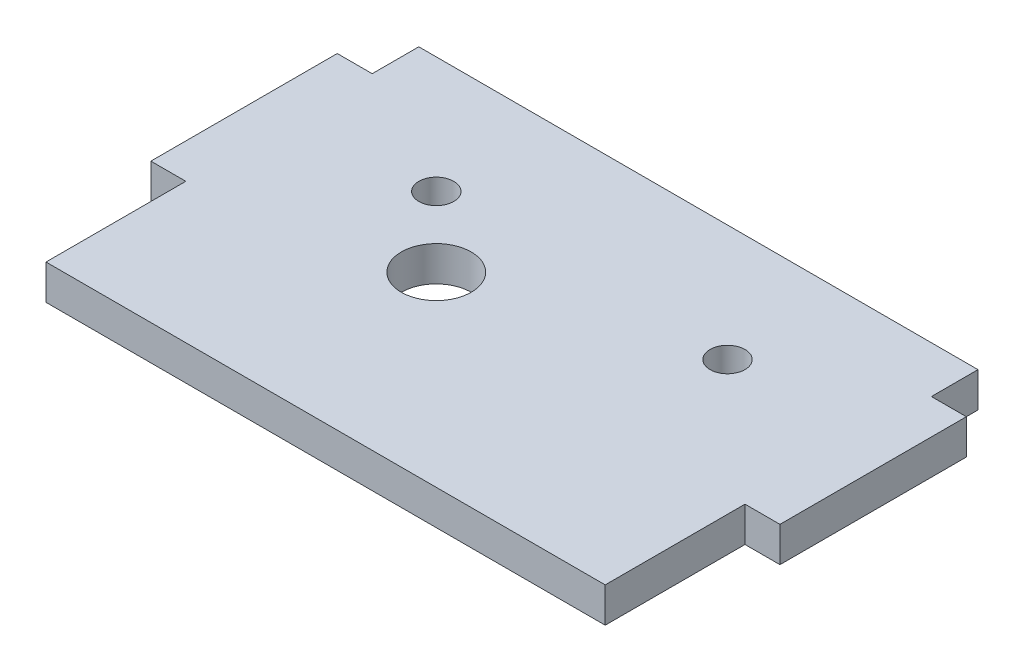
ISO-10303-21;
HEADER;
FILE_DESCRIPTION(('STEP AP214'),'2;1');
FILE_NAME('part.step','',(''),(''),'','','');
FILE_SCHEMA(('AUTOMOTIVE_DESIGN { 1 0 10303 214 1 1 1 1 }'));
ENDSEC;
DATA;
#1=APPLICATION_CONTEXT('core data for automotive mechanical design processes');
#2=APPLICATION_PROTOCOL_DEFINITION('international standard','automotive_design',2000,#1);
#3=PRODUCT_CONTEXT('',#1,'mechanical');
#4=PRODUCT('Part','Part','',(#3));
#5=PRODUCT_RELATED_PRODUCT_CATEGORY('part','',(#4));
#6=PRODUCT_DEFINITION_FORMATION('','',#4);
#7=PRODUCT_DEFINITION_CONTEXT('part definition',#1,'design');
#8=PRODUCT_DEFINITION('design','',#6,#7);
#9=PRODUCT_DEFINITION_SHAPE('','',#8);
#10=(LENGTH_UNIT() NAMED_UNIT(*) SI_UNIT(.MILLI.,.METRE.));
#11=(NAMED_UNIT(*) PLANE_ANGLE_UNIT() SI_UNIT($,.RADIAN.));
#12=(NAMED_UNIT(*) SI_UNIT($,.STERADIAN.) SOLID_ANGLE_UNIT());
#13=UNCERTAINTY_MEASURE_WITH_UNIT(LENGTH_MEASURE(1.E-05),#10,'distance_accuracy_value','');
#14=(GEOMETRIC_REPRESENTATION_CONTEXT(3) GLOBAL_UNCERTAINTY_ASSIGNED_CONTEXT((#13)) GLOBAL_UNIT_ASSIGNED_CONTEXT((#10,
#11,#12)) REPRESENTATION_CONTEXT('',''));
#15=CARTESIAN_POINT('',(0.,0.,0.));
#16=DIRECTION('',(0.,0.,1.));
#17=DIRECTION('',(1.,0.,0.));
#18=AXIS2_PLACEMENT_3D('',#15,#16,#17);
#19=CARTESIAN_POINT('',(24.,3.,-10.));
#20=DIRECTION('',(-1.,0.,0.));
#21=DIRECTION('',(0.,0.,1.));
#22=AXIS2_PLACEMENT_3D('',#19,#20,#21);
#23=PLANE('',#22);
#24=DIRECTION('',(0.,-1.,0.));
#25=VECTOR('',#24,1.);
#26=CARTESIAN_POINT('',(24.,3.,10.));
#27=LINE('',#26,#25);
#28=CARTESIAN_POINT('',(24.,3.,10.));
#29=VERTEX_POINT('',#28);
#30=CARTESIAN_POINT('',(24.,0.,10.));
#31=VERTEX_POINT('',#30);
#32=EDGE_CURVE('E55',#29,#31,#27,.T.);
#33=ORIENTED_EDGE('',*,*,#32,.F.);
#34=DIRECTION('',(0.,0.,-1.));
#35=VECTOR('',#34,1.);
#36=CARTESIAN_POINT('',(24.,3.,-10.));
#37=LINE('',#36,#35);
#38=CARTESIAN_POINT('',(24.,3.,22.));
#39=VERTEX_POINT('',#38);
#40=EDGE_CURVE('E141',#39,#29,#37,.T.);
#41=ORIENTED_EDGE('',*,*,#40,.F.);
#42=DIRECTION('',(0.,-1.,0.));
#43=VECTOR('',#42,1.);
#44=CARTESIAN_POINT('',(24.,3.,22.));
#45=LINE('',#44,#43);
#46=CARTESIAN_POINT('',(24.,0.,22.));
#47=VERTEX_POINT('',#46);
#48=EDGE_CURVE('E166',#39,#47,#45,.T.);
#49=ORIENTED_EDGE('',*,*,#48,.T.);
#50=DIRECTION('',(0.,0.,-1.));
#51=VECTOR('',#50,1.);
#52=CARTESIAN_POINT('',(24.,0.,-10.));
#53=LINE('',#52,#51);
#54=EDGE_CURVE('E51',#47,#31,#53,.T.);
#55=ORIENTED_EDGE('',*,*,#54,.T.);
#56=EDGE_LOOP('',(#33,#41,#49,#55));
#57=FACE_BOUND('',#56,.T.);
#58=ADVANCED_FACE('F33',(#57),#23,.F.);
#59=CARTESIAN_POINT('',(-24.,3.,-10.));
#60=DIRECTION('',(1.,0.,0.));
#61=DIRECTION('',(0.,0.,-1.));
#62=AXIS2_PLACEMENT_3D('',#59,#60,#61);
#63=PLANE('',#62);
#64=DIRECTION('',(0.,-1.,0.));
#65=VECTOR('',#64,1.);
#66=CARTESIAN_POINT('',(-24.,3.,10.));
#67=LINE('',#66,#65);
#68=CARTESIAN_POINT('',(-24.,3.,10.));
#69=VERTEX_POINT('',#68);
#70=CARTESIAN_POINT('',(-24.,0.,10.));
#71=VERTEX_POINT('',#70);
#72=EDGE_CURVE('E156',#69,#71,#67,.T.);
#73=ORIENTED_EDGE('',*,*,#72,.T.);
#74=DIRECTION('',(0.,0.,1.));
#75=VECTOR('',#74,1.);
#76=CARTESIAN_POINT('',(-24.,0.,-10.));
#77=LINE('',#76,#75);
#78=CARTESIAN_POINT('',(-24.,0.,22.));
#79=VERTEX_POINT('',#78);
#80=EDGE_CURVE('E37',#71,#79,#77,.T.);
#81=ORIENTED_EDGE('',*,*,#80,.T.);
#82=DIRECTION('',(0.,-1.,0.));
#83=VECTOR('',#82,1.);
#84=CARTESIAN_POINT('',(-24.,3.,22.));
#85=LINE('',#84,#83);
#86=CARTESIAN_POINT('',(-24.,3.,22.));
#87=VERTEX_POINT('',#86);
#88=EDGE_CURVE('E170',#87,#79,#85,.T.);
#89=ORIENTED_EDGE('',*,*,#88,.F.);
#90=DIRECTION('',(0.,0.,1.));
#91=VECTOR('',#90,1.);
#92=CARTESIAN_POINT('',(-24.,3.,-10.));
#93=LINE('',#92,#91);
#94=EDGE_CURVE('E209',#69,#87,#93,.T.);
#95=ORIENTED_EDGE('',*,*,#94,.F.);
#96=EDGE_LOOP('',(#73,#81,#89,#95));
#97=FACE_BOUND('',#96,.T.);
#98=ADVANCED_FACE('F293',(#97),#63,.F.);
#99=CARTESIAN_POINT('',(24.,3.,9.99999999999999));
#100=DIRECTION('',(0.,1.,0.));
#101=DIRECTION('',(0.,0.,1.));
#102=AXIS2_PLACEMENT_3D('',#99,#100,#101);
#103=PLANE('',#102);
#104=ORIENTED_EDGE('',*,*,#40,.T.);
#105=DIRECTION('',(1.,0.,0.));
#106=VECTOR('',#105,1.);
#107=CARTESIAN_POINT('',(27.,3.,10.));
#108=LINE('',#107,#106);
#109=CARTESIAN_POINT('',(27.,3.,10.));
#110=VERTEX_POINT('',#109);
#111=EDGE_CURVE('E137',#29,#110,#108,.T.);
#112=ORIENTED_EDGE('',*,*,#111,.T.);
#113=DIRECTION('',(0.,0.,-1.));
#114=VECTOR('',#113,1.);
#115=CARTESIAN_POINT('',(27.,3.,-5.99999999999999));
#116=LINE('',#115,#114);
#117=CARTESIAN_POINT('',(27.,3.,-5.99999999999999));
#118=VERTEX_POINT('',#117);
#119=EDGE_CURVE('E124',#110,#118,#116,.T.);
#120=ORIENTED_EDGE('',*,*,#119,.T.);
#121=DIRECTION('',(-1.,0.,0.));
#122=VECTOR('',#121,1.);
#123=CARTESIAN_POINT('',(27.,3.,-5.99999999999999));
#124=LINE('',#123,#122);
#125=CARTESIAN_POINT('',(24.,3.,-5.99999999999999));
#126=VERTEX_POINT('',#125);
#127=EDGE_CURVE('E133',#118,#126,#124,.T.);
#128=ORIENTED_EDGE('',*,*,#127,.T.);
#129=CARTESIAN_POINT('',(24.,3.,-10.));
#130=VERTEX_POINT('',#129);
#131=EDGE_CURVE('E201',#126,#130,#37,.T.);
#132=ORIENTED_EDGE('',*,*,#131,.T.);
#133=DIRECTION('',(-1.,0.,0.));
#134=VECTOR('',#133,1.);
#135=CARTESIAN_POINT('',(-24.,3.,-10.));
#136=LINE('',#135,#134);
#137=CARTESIAN_POINT('',(-24.,3.,-10.));
#138=VERTEX_POINT('',#137);
#139=EDGE_CURVE('E212',#130,#138,#136,.T.);
#140=ORIENTED_EDGE('',*,*,#139,.T.);
#141=CARTESIAN_POINT('',(-24.,3.,-5.99999999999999));
#142=VERTEX_POINT('',#141);
#143=EDGE_CURVE('E211',#138,#142,#93,.T.);
#144=ORIENTED_EDGE('',*,*,#143,.T.);
#145=DIRECTION('',(-1.,0.,0.));
#146=VECTOR('',#145,1.);
#147=CARTESIAN_POINT('',(-27.,3.,-5.99999999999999));
#148=LINE('',#147,#146);
#149=CARTESIAN_POINT('',(-27.,3.,-5.99999999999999));
#150=VERTEX_POINT('',#149);
#151=EDGE_CURVE('E224',#142,#150,#148,.T.);
#152=ORIENTED_EDGE('',*,*,#151,.T.);
#153=DIRECTION('',(0.,0.,1.));
#154=VECTOR('',#153,1.);
#155=CARTESIAN_POINT('',(-27.,3.,-5.99999999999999));
#156=LINE('',#155,#154);
#157=CARTESIAN_POINT('',(-27.,3.,10.));
#158=VERTEX_POINT('',#157);
#159=EDGE_CURVE('E226',#150,#158,#156,.T.);
#160=ORIENTED_EDGE('',*,*,#159,.T.);
#161=DIRECTION('',(1.,0.,0.));
#162=VECTOR('',#161,1.);
#163=CARTESIAN_POINT('',(-27.,3.,10.));
#164=LINE('',#163,#162);
#165=EDGE_CURVE('E153',#158,#69,#164,.T.);
#166=ORIENTED_EDGE('',*,*,#165,.T.);
#167=ORIENTED_EDGE('',*,*,#94,.T.);
#168=DIRECTION('',(1.,0.,0.));
#169=VECTOR('',#168,1.);
#170=CARTESIAN_POINT('',(-24.,3.,22.));
#171=LINE('',#170,#169);
#172=EDGE_CURVE('E164',#87,#39,#171,.T.);
#173=ORIENTED_EDGE('',*,*,#172,.T.);
#174=EDGE_LOOP('',(#104,#112,#120,#128,#132,#140,#144,#152,#160,#166,#167,#173));
#175=FACE_BOUND('',#174,.T.);
#176=CARTESIAN_POINT('',(-12.5,3.,0.));
#177=DIRECTION('',(0.,1.,0.));
#178=DIRECTION('',(0.,0.,1.));
#179=AXIS2_PLACEMENT_3D('',#176,#177,#178);
#180=CIRCLE('',#179,1.5);
#181=CARTESIAN_POINT('',(-12.5,3.,1.5));
#182=VERTEX_POINT('',#181);
#183=EDGE_CURVE('E180',#182,#182,#180,.T.);
#184=ORIENTED_EDGE('',*,*,#183,.F.);
#185=EDGE_LOOP('',(#184));
#186=FACE_BOUND('',#185,.T.);
#187=CARTESIAN_POINT('',(-6.5,3.,6.));
#188=DIRECTION('',(0.,1.,0.));
#189=DIRECTION('',(0.,0.,1.));
#190=AXIS2_PLACEMENT_3D('',#187,#188,#189);
#191=CIRCLE('',#190,3.);
#192=CARTESIAN_POINT('',(-6.5,3.,9.));
#193=VERTEX_POINT('',#192);
#194=EDGE_CURVE('E186',#193,#193,#191,.T.);
#195=ORIENTED_EDGE('',*,*,#194,.F.);
#196=EDGE_LOOP('',(#195));
#197=FACE_BOUND('',#196,.T.);
#198=CARTESIAN_POINT('',(12.5,3.,0.));
#199=DIRECTION('',(0.,1.,0.));
#200=DIRECTION('',(0.,0.,1.));
#201=AXIS2_PLACEMENT_3D('',#198,#199,#200);
#202=CIRCLE('',#201,1.5);
#203=CARTESIAN_POINT('',(12.5,3.,1.5));
#204=VERTEX_POINT('',#203);
#205=EDGE_CURVE('E174',#204,#204,#202,.T.);
#206=ORIENTED_EDGE('',*,*,#205,.F.);
#207=EDGE_LOOP('',(#206));
#208=FACE_BOUND('',#207,.T.);
#209=ADVANCED_FACE('F138',(#175,#186,#197,#208),#103,.T.);
#210=CARTESIAN_POINT('',(24.,0.,9.99999999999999));
#211=DIRECTION('',(0.,1.,0.));
#212=DIRECTION('',(0.,0.,1.));
#213=AXIS2_PLACEMENT_3D('',#210,#211,#212);
#214=PLANE('',#213);
#215=DIRECTION('',(1.,0.,0.));
#216=VECTOR('',#215,1.);
#217=CARTESIAN_POINT('',(27.,0.,10.));
#218=LINE('',#217,#216);
#219=CARTESIAN_POINT('',(27.,0.,10.));
#220=VERTEX_POINT('',#219);
#221=EDGE_CURVE('E143',#31,#220,#218,.T.);
#222=ORIENTED_EDGE('',*,*,#221,.F.);
#223=ORIENTED_EDGE('',*,*,#54,.F.);
#224=DIRECTION('',(1.,0.,0.));
#225=VECTOR('',#224,1.);
#226=CARTESIAN_POINT('',(-24.,0.,22.));
#227=LINE('',#226,#225);
#228=EDGE_CURVE('E163',#79,#47,#227,.T.);
#229=ORIENTED_EDGE('',*,*,#228,.F.);
#230=ORIENTED_EDGE('',*,*,#80,.F.);
#231=DIRECTION('',(1.,0.,0.));
#232=VECTOR('',#231,1.);
#233=CARTESIAN_POINT('',(-27.,0.,10.));
#234=LINE('',#233,#232);
#235=CARTESIAN_POINT('',(-27.,0.,10.));
#236=VERTEX_POINT('',#235);
#237=EDGE_CURVE('E149',#236,#71,#234,.T.);
#238=ORIENTED_EDGE('',*,*,#237,.F.);
#239=DIRECTION('',(0.,0.,1.));
#240=VECTOR('',#239,1.);
#241=CARTESIAN_POINT('',(-27.,0.,-5.99999999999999));
#242=LINE('',#241,#240);
#243=CARTESIAN_POINT('',(-27.,0.,-5.99999999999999));
#244=VERTEX_POINT('',#243);
#245=EDGE_CURVE('E227',#244,#236,#242,.T.);
#246=ORIENTED_EDGE('',*,*,#245,.F.);
#247=DIRECTION('',(-1.,0.,0.));
#248=VECTOR('',#247,1.);
#249=CARTESIAN_POINT('',(-27.,0.,-5.99999999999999));
#250=LINE('',#249,#248);
#251=CARTESIAN_POINT('',(-24.,0.,-5.99999999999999));
#252=VERTEX_POINT('',#251);
#253=EDGE_CURVE('E236',#252,#244,#250,.T.);
#254=ORIENTED_EDGE('',*,*,#253,.F.);
#255=CARTESIAN_POINT('',(-24.,0.,-10.));
#256=VERTEX_POINT('',#255);
#257=EDGE_CURVE('E223',#256,#252,#77,.T.);
#258=ORIENTED_EDGE('',*,*,#257,.F.);
#259=DIRECTION('',(-1.,0.,0.));
#260=VECTOR('',#259,1.);
#261=CARTESIAN_POINT('',(-24.,0.,-10.));
#262=LINE('',#261,#260);
#263=CARTESIAN_POINT('',(24.,0.,-10.));
#264=VERTEX_POINT('',#263);
#265=EDGE_CURVE('E245',#264,#256,#262,.T.);
#266=ORIENTED_EDGE('',*,*,#265,.F.);
#267=CARTESIAN_POINT('',(24.,0.,-5.99999999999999));
#268=VERTEX_POINT('',#267);
#269=EDGE_CURVE('E234',#268,#264,#53,.T.);
#270=ORIENTED_EDGE('',*,*,#269,.F.);
#271=DIRECTION('',(-1.,0.,0.));
#272=VECTOR('',#271,1.);
#273=CARTESIAN_POINT('',(27.,0.,-5.99999999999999));
#274=LINE('',#273,#272);
#275=CARTESIAN_POINT('',(27.,0.,-5.99999999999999));
#276=VERTEX_POINT('',#275);
#277=EDGE_CURVE('E134',#276,#268,#274,.T.);
#278=ORIENTED_EDGE('',*,*,#277,.F.);
#279=DIRECTION('',(0.,0.,-1.));
#280=VECTOR('',#279,1.);
#281=CARTESIAN_POINT('',(27.,0.,-5.99999999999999));
#282=LINE('',#281,#280);
#283=EDGE_CURVE('E189',#220,#276,#282,.T.);
#284=ORIENTED_EDGE('',*,*,#283,.F.);
#285=EDGE_LOOP('',(#222,#223,#229,#230,#238,#246,#254,#258,#266,#270,#278,#284));
#286=FACE_BOUND('',#285,.T.);
#287=CARTESIAN_POINT('',(-12.5,0.,0.));
#288=DIRECTION('',(0.,1.,0.));
#289=DIRECTION('',(0.,0.,1.));
#290=AXIS2_PLACEMENT_3D('',#287,#288,#289);
#291=CIRCLE('',#290,1.5);
#292=CARTESIAN_POINT('',(-12.5,0.,1.5));
#293=VERTEX_POINT('',#292);
#294=EDGE_CURVE('E177',#293,#293,#291,.T.);
#295=ORIENTED_EDGE('',*,*,#294,.T.);
#296=EDGE_LOOP('',(#295));
#297=FACE_BOUND('',#296,.T.);
#298=CARTESIAN_POINT('',(-6.5,0.,6.));
#299=DIRECTION('',(0.,1.,0.));
#300=DIRECTION('',(0.,0.,1.));
#301=AXIS2_PLACEMENT_3D('',#298,#299,#300);
#302=CIRCLE('',#301,3.);
#303=CARTESIAN_POINT('',(-6.5,0.,9.));
#304=VERTEX_POINT('',#303);
#305=EDGE_CURVE('E183',#304,#304,#302,.T.);
#306=ORIENTED_EDGE('',*,*,#305,.T.);
#307=EDGE_LOOP('',(#306));
#308=FACE_BOUND('',#307,.T.);
#309=CARTESIAN_POINT('',(12.5,0.,0.));
#310=DIRECTION('',(0.,1.,0.));
#311=DIRECTION('',(0.,0.,1.));
#312=AXIS2_PLACEMENT_3D('',#309,#310,#311);
#313=CIRCLE('',#312,1.5);
#314=CARTESIAN_POINT('',(12.5,0.,1.5));
#315=VERTEX_POINT('',#314);
#316=EDGE_CURVE('E173',#315,#315,#313,.T.);
#317=ORIENTED_EDGE('',*,*,#316,.T.);
#318=EDGE_LOOP('',(#317));
#319=FACE_BOUND('',#318,.T.);
#320=ADVANCED_FACE('F262',(#286,#297,#308,#319),#214,.F.);
#321=DIRECTION('',(0.,-1.,0.));
#322=VECTOR('',#321,1.);
#323=CARTESIAN_POINT('',(-24.,3.,-5.99999999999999));
#324=LINE('',#323,#322);
#325=EDGE_CURVE('E230',#142,#252,#324,.T.);
#326=ORIENTED_EDGE('',*,*,#325,.F.);
#327=ORIENTED_EDGE('',*,*,#143,.F.);
#328=DIRECTION('',(0.,-1.,0.));
#329=VECTOR('',#328,1.);
#330=CARTESIAN_POINT('',(-24.,3.,-10.));
#331=LINE('',#330,#329);
#332=EDGE_CURVE('E43',#138,#256,#331,.T.);
#333=ORIENTED_EDGE('',*,*,#332,.T.);
#334=ORIENTED_EDGE('',*,*,#257,.T.);
#335=EDGE_LOOP('',(#326,#327,#333,#334));
#336=FACE_BOUND('',#335,.T.);
#337=ADVANCED_FACE('F259',(#336),#63,.F.);
#338=ORIENTED_EDGE('',*,*,#131,.F.);
#339=DIRECTION('',(0.,-1.,0.));
#340=VECTOR('',#339,1.);
#341=CARTESIAN_POINT('',(24.,3.,-5.99999999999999));
#342=LINE('',#341,#340);
#343=EDGE_CURVE('E197',#126,#268,#342,.T.);
#344=ORIENTED_EDGE('',*,*,#343,.T.);
#345=ORIENTED_EDGE('',*,*,#269,.T.);
#346=DIRECTION('',(0.,-1.,0.));
#347=VECTOR('',#346,1.);
#348=CARTESIAN_POINT('',(24.,3.,-10.));
#349=LINE('',#348,#347);
#350=EDGE_CURVE('E11',#130,#264,#349,.T.);
#351=ORIENTED_EDGE('',*,*,#350,.F.);
#352=EDGE_LOOP('',(#338,#344,#345,#351));
#353=FACE_BOUND('',#352,.T.);
#354=ADVANCED_FACE('F35',(#353),#23,.F.);
#355=CARTESIAN_POINT('',(-24.,3.,-10.));
#356=DIRECTION('',(0.,0.,1.));
#357=DIRECTION('',(1.,0.,0.));
#358=AXIS2_PLACEMENT_3D('',#355,#356,#357);
#359=PLANE('',#358);
#360=ORIENTED_EDGE('',*,*,#265,.T.);
#361=ORIENTED_EDGE('',*,*,#332,.F.);
#362=ORIENTED_EDGE('',*,*,#139,.F.);
#363=ORIENTED_EDGE('',*,*,#350,.T.);
#364=EDGE_LOOP('',(#360,#361,#362,#363));
#365=FACE_BOUND('',#364,.T.);
#366=ADVANCED_FACE('F270',(#365),#359,.F.);
#367=CARTESIAN_POINT('',(-27.,3.,-5.99999999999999));
#368=DIRECTION('',(0.,0.,1.));
#369=DIRECTION('',(1.,0.,0.));
#370=AXIS2_PLACEMENT_3D('',#367,#368,#369);
#371=PLANE('',#370);
#372=ORIENTED_EDGE('',*,*,#253,.T.);
#373=DIRECTION('',(0.,-1.,0.));
#374=VECTOR('',#373,1.);
#375=CARTESIAN_POINT('',(-27.,3.,-5.99999999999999));
#376=LINE('',#375,#374);
#377=EDGE_CURVE('E235',#150,#244,#376,.T.);
#378=ORIENTED_EDGE('',*,*,#377,.F.);
#379=ORIENTED_EDGE('',*,*,#151,.F.);
#380=ORIENTED_EDGE('',*,*,#325,.T.);
#381=EDGE_LOOP('',(#372,#378,#379,#380));
#382=FACE_BOUND('',#381,.T.);
#383=ADVANCED_FACE('F305',(#382),#371,.F.);
#384=CARTESIAN_POINT('',(-27.,3.,-5.99999999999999));
#385=DIRECTION('',(1.,0.,0.));
#386=DIRECTION('',(0.,0.,-1.));
#387=AXIS2_PLACEMENT_3D('',#384,#385,#386);
#388=PLANE('',#387);
#389=ORIENTED_EDGE('',*,*,#245,.T.);
#390=DIRECTION('',(0.,-1.,0.));
#391=VECTOR('',#390,1.);
#392=CARTESIAN_POINT('',(-27.,3.,10.));
#393=LINE('',#392,#391);
#394=EDGE_CURVE('E160',#158,#236,#393,.T.);
#395=ORIENTED_EDGE('',*,*,#394,.F.);
#396=ORIENTED_EDGE('',*,*,#159,.F.);
#397=ORIENTED_EDGE('',*,*,#377,.T.);
#398=EDGE_LOOP('',(#389,#395,#396,#397));
#399=FACE_BOUND('',#398,.T.);
#400=ADVANCED_FACE('F281',(#399),#388,.F.);
#401=CARTESIAN_POINT('',(27.,3.,-5.99999999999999));
#402=DIRECTION('',(-1.,0.,0.));
#403=DIRECTION('',(0.,0.,1.));
#404=AXIS2_PLACEMENT_3D('',#401,#402,#403);
#405=PLANE('',#404);
#406=ORIENTED_EDGE('',*,*,#283,.T.);
#407=DIRECTION('',(0.,-1.,0.));
#408=VECTOR('',#407,1.);
#409=CARTESIAN_POINT('',(27.,3.,-5.99999999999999));
#410=LINE('',#409,#408);
#411=EDGE_CURVE('E131',#118,#276,#410,.T.);
#412=ORIENTED_EDGE('',*,*,#411,.F.);
#413=ORIENTED_EDGE('',*,*,#119,.F.);
#414=DIRECTION('',(0.,-1.,0.));
#415=VECTOR('',#414,1.);
#416=CARTESIAN_POINT('',(27.,3.,10.));
#417=LINE('',#416,#415);
#418=EDGE_CURVE('E129',#110,#220,#417,.T.);
#419=ORIENTED_EDGE('',*,*,#418,.T.);
#420=EDGE_LOOP('',(#406,#412,#413,#419));
#421=FACE_BOUND('',#420,.T.);
#422=ADVANCED_FACE('F127',(#421),#405,.F.);
#423=CARTESIAN_POINT('',(27.,3.,-5.99999999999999));
#424=DIRECTION('',(0.,0.,1.));
#425=DIRECTION('',(1.,0.,0.));
#426=AXIS2_PLACEMENT_3D('',#423,#424,#425);
#427=PLANE('',#426);
#428=ORIENTED_EDGE('',*,*,#277,.T.);
#429=ORIENTED_EDGE('',*,*,#343,.F.);
#430=ORIENTED_EDGE('',*,*,#127,.F.);
#431=ORIENTED_EDGE('',*,*,#411,.T.);
#432=EDGE_LOOP('',(#428,#429,#430,#431));
#433=FACE_BOUND('',#432,.T.);
#434=ADVANCED_FACE('F272',(#433),#427,.F.);
#435=CARTESIAN_POINT('',(-6.5,3.,6.));
#436=DIRECTION('',(0.,-1.,0.));
#437=DIRECTION('',(0.,0.,-1.));
#438=AXIS2_PLACEMENT_3D('',#435,#436,#437);
#439=CYLINDRICAL_SURFACE('',#438,3.);
#440=ORIENTED_EDGE('',*,*,#194,.T.);
#441=EDGE_LOOP('',(#440));
#442=FACE_BOUND('',#441,.T.);
#443=ORIENTED_EDGE('',*,*,#305,.F.);
#444=EDGE_LOOP('',(#443));
#445=FACE_BOUND('',#444,.T.);
#446=ADVANCED_FACE('F321',(#442,#445),#439,.F.);
#447=CARTESIAN_POINT('',(-12.5,3.,0.));
#448=DIRECTION('',(0.,-1.,0.));
#449=DIRECTION('',(0.,0.,-1.));
#450=AXIS2_PLACEMENT_3D('',#447,#448,#449);
#451=CYLINDRICAL_SURFACE('',#450,1.5);
#452=ORIENTED_EDGE('',*,*,#183,.T.);
#453=EDGE_LOOP('',(#452));
#454=FACE_BOUND('',#453,.T.);
#455=ORIENTED_EDGE('',*,*,#294,.F.);
#456=EDGE_LOOP('',(#455));
#457=FACE_BOUND('',#456,.T.);
#458=ADVANCED_FACE('F324',(#454,#457),#451,.F.);
#459=CARTESIAN_POINT('',(12.5,3.,0.));
#460=DIRECTION('',(0.,-1.,0.));
#461=DIRECTION('',(0.,0.,-1.));
#462=AXIS2_PLACEMENT_3D('',#459,#460,#461);
#463=CYLINDRICAL_SURFACE('',#462,1.5);
#464=ORIENTED_EDGE('',*,*,#205,.T.);
#465=EDGE_LOOP('',(#464));
#466=FACE_BOUND('',#465,.T.);
#467=ORIENTED_EDGE('',*,*,#316,.F.);
#468=EDGE_LOOP('',(#467));
#469=FACE_BOUND('',#468,.T.);
#470=ADVANCED_FACE('F328',(#466,#469),#463,.F.);
#471=CARTESIAN_POINT('',(-24.,3.,22.));
#472=DIRECTION('',(0.,0.,-1.));
#473=DIRECTION('',(-1.,0.,0.));
#474=AXIS2_PLACEMENT_3D('',#471,#472,#473);
#475=PLANE('',#474);
#476=ORIENTED_EDGE('',*,*,#228,.T.);
#477=ORIENTED_EDGE('',*,*,#48,.F.);
#478=ORIENTED_EDGE('',*,*,#172,.F.);
#479=ORIENTED_EDGE('',*,*,#88,.T.);
#480=EDGE_LOOP('',(#476,#477,#478,#479));
#481=FACE_BOUND('',#480,.T.);
#482=ADVANCED_FACE('F292',(#481),#475,.F.);
#483=CARTESIAN_POINT('',(-27.,3.,10.));
#484=DIRECTION('',(0.,0.,-1.));
#485=DIRECTION('',(-1.,0.,0.));
#486=AXIS2_PLACEMENT_3D('',#483,#484,#485);
#487=PLANE('',#486);
#488=ORIENTED_EDGE('',*,*,#237,.T.);
#489=ORIENTED_EDGE('',*,*,#72,.F.);
#490=ORIENTED_EDGE('',*,*,#165,.F.);
#491=ORIENTED_EDGE('',*,*,#394,.T.);
#492=EDGE_LOOP('',(#488,#489,#490,#491));
#493=FACE_BOUND('',#492,.T.);
#494=ADVANCED_FACE('F286',(#493),#487,.F.);
#495=CARTESIAN_POINT('',(27.,3.,10.));
#496=DIRECTION('',(0.,0.,-1.));
#497=DIRECTION('',(-1.,0.,0.));
#498=AXIS2_PLACEMENT_3D('',#495,#496,#497);
#499=PLANE('',#498);
#500=ORIENTED_EDGE('',*,*,#221,.T.);
#501=ORIENTED_EDGE('',*,*,#418,.F.);
#502=ORIENTED_EDGE('',*,*,#111,.F.);
#503=ORIENTED_EDGE('',*,*,#32,.T.);
#504=EDGE_LOOP('',(#500,#501,#502,#503));
#505=FACE_BOUND('',#504,.T.);
#506=ADVANCED_FACE('F146',(#505),#499,.F.);
#507=CLOSED_SHELL('',(#58,#98,#209,#320,#337,#354,#366,#383,#400,#422,#434,#446,#458,#470,#482,
#494,#506));
#508=MANIFOLD_SOLID_BREP('B2',#507);
#509=ADVANCED_BREP_SHAPE_REPRESENTATION('',(#18,#508),#14);
#510=SHAPE_DEFINITION_REPRESENTATION(#9,#509);
ENDSEC;
END-ISO-10303-21;
